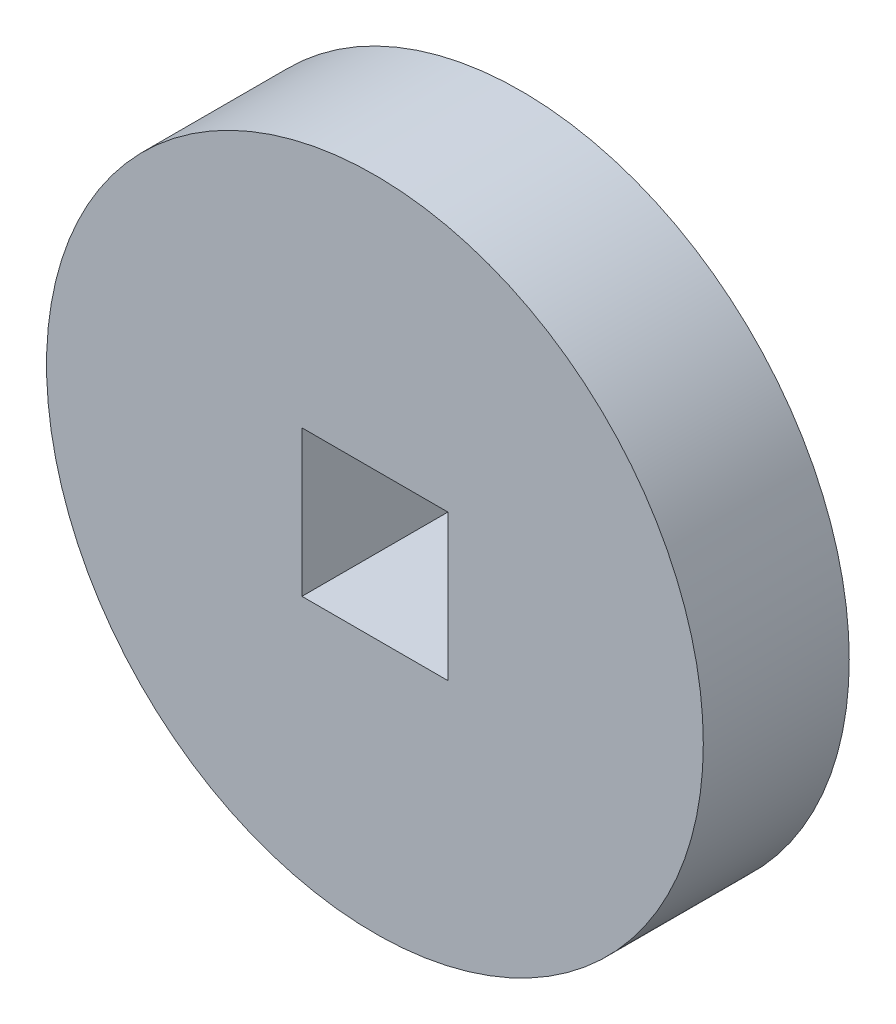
from build123d import *

# Parameters (mm, degrees)
SKETCH1_R           = 14.2875
SKETCH1_W           = 6.35
SKETCH1_H           = 6.35
BOSS_EXTRUDE1_DEPTH = 6.35


with BuildPart() as part:
    # Sketch1 → Boss-Extrude1 (new body)
    with BuildSketch(Plane.XY):
        Circle(SKETCH1_R)
        Rectangle(SKETCH1_W, SKETCH1_H, mode=Mode.SUBTRACT)
    extrude(amount=BOSS_EXTRUDE1_DEPTH)


solid = part.part
